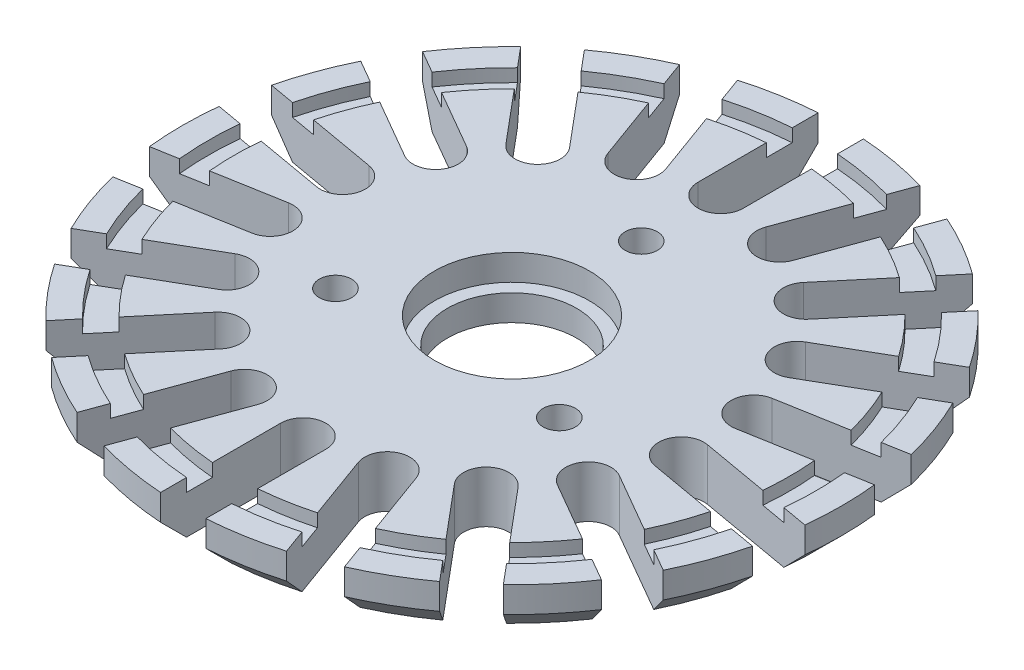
from build123d import *

# Parameters (mm, degrees)
ESBO_O1_R                = 5
RESSALTO_EXTRUS_O1_DEPTH = 4
ESBO_O2_R                = 6
CORTE_EXTRUS_O1_DEPTH    = 2
ESBO_O3_R                = 23.5
ESBO_O3_R_2              = 21.5
CORTE_EXTRUS_O2_DEPTH    = 1
CHANFRO1_SIZE            = 2
ESBO_O4_R                = 1.25
CORTE_EXTRUS_O3_DEPTH    = 37.241378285


with BuildPart() as part:
    # Esbo_o1 → Ressalto-extrus_o1 (new body)
    with BuildSketch(Plane(origin=(0, 0, 0), x_dir=(1, 0, 0), z_dir=(0, 1, 0))):
        with BuildLine():
            Line((1.75, 16.15), (1.75, 25.43988011))
            ThreePointArc((1.75, 25.43988011), (4.428028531, 25.112597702), (7.056489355, 24.504202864))
            Line((7.056489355, 24.504202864), (3.879163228, 15.774571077))
            ThreePointArc((3.879163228, 15.774571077), (4.925090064, 13.531573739), (7.168087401, 14.577500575))
            Line((7.168087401, 14.577500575), (10.345413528, 23.307132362))
            ThreePointArc((10.345413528, 23.307132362), (12.75, 22.083647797), (15.011861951, 20.612957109))
            Line((15.011861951, 20.612957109), (9.040442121, 13.496496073))
            ThreePointArc((9.040442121, 13.496496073), (9.256141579, 11.031039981), (11.721597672, 11.246739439))
            Line((11.721597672, 11.246739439), (17.693017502, 18.363200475))
            ThreePointArc((17.693017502, 18.363200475), (19.5341333, 16.391084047), (21.156582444, 14.235484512))
            Line((21.156582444, 14.235484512), (13.111310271, 9.590544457))
            ThreePointArc((13.111310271, 9.590544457), (12.470765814, 7.2), (14.861310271, 6.559455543))
            Line((14.861310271, 6.559455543), (22.906582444, 11.204395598))
            ThreePointArc((22.906582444, 11.204395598), (23.96216183, 8.721513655), (24.749506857, 6.141002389))
            Line((24.749506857, 6.141002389), (15.6007609, 4.527831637))
            ThreePointArc((15.6007609, 4.527831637), (14.181231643, 2.500533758), (16.208529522, 1.081004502))
            Line((16.208529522, 1.081004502), (25.357275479, 2.694175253))
            ThreePointArc((25.357275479, 2.694175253), (25.5, 0), (25.357275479, -2.694175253))
            Line((25.357275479, -2.694175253), (16.208529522, -1.081004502))
            ThreePointArc((16.208529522, -1.081004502), (14.181231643, -2.500533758), (15.6007609, -4.527831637))
            Line((15.6007609, -4.527831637), (24.749506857, -6.141002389))
            ThreePointArc((24.749506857, -6.141002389), (23.96216183, -8.721513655), (22.906582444, -11.204395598))
            Line((22.906582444, -11.204395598), (14.861310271, -6.559455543))
            ThreePointArc((14.861310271, -6.559455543), (12.470765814, -7.2), (13.111310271, -9.590544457))
            Line((13.111310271, -9.590544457), (21.156582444, -14.235484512))
            ThreePointArc((21.156582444, -14.235484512), (19.5341333, -16.391084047), (17.693017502, -18.363200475))
            Line((17.693017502, -18.363200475), (11.721597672, -11.246739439))
            ThreePointArc((11.721597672, -11.246739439), (9.256141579, -11.031039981), (9.040442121, -13.496496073))
            Line((9.040442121, -13.496496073), (15.011861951, -20.612957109))
            ThreePointArc((15.011861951, -20.612957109), (12.75, -22.083647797), (10.345413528, -23.307132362))
            Line((10.345413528, -23.307132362), (7.168087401, -14.577500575))
            ThreePointArc((7.168087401, -14.577500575), (4.925090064, -13.531573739), (3.879163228, -15.774571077))
            Line((3.879163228, -15.774571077), (7.056489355, -24.504202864))
            ThreePointArc((7.056489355, -24.504202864), (4.428028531, -25.112597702), (1.75, -25.43988011))
            Line((1.75, -25.43988011), (1.75, -16.15))
            ThreePointArc((1.75, -16.15), (0, -14.4), (-1.75, -16.15))
            Line((-1.75, -16.15), (-1.75, -25.43988011))
            ThreePointArc((-1.75, -25.43988011), (-4.428028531, -25.112597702), (-7.056489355, -24.504202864))
            Line((-7.056489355, -24.504202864), (-3.879163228, -15.774571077))
            ThreePointArc((-3.879163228, -15.774571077), (-4.925090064, -13.531573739), (-7.168087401, -14.577500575))
            Line((-7.168087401, -14.577500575), (-10.345413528, -23.307132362))
            ThreePointArc((-10.345413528, -23.307132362), (-12.75, -22.083647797), (-15.011861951, -20.612957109))
            Line((-15.011861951, -20.612957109), (-9.040442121, -13.496496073))
            ThreePointArc((-9.040442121, -13.496496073), (-9.256141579, -11.031039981), (-11.721597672, -11.246739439))
            Line((-11.721597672, -11.246739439), (-17.693017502, -18.363200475))
            ThreePointArc((-17.693017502, -18.363200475), (-19.5341333, -16.391084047), (-21.156582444, -14.235484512))
            Line((-21.156582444, -14.235484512), (-13.111310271, -9.590544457))
            ThreePointArc((-13.111310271, -9.590544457), (-12.470765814, -7.2), (-14.861310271, -6.559455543))
            Line((-14.861310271, -6.559455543), (-22.906582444, -11.204395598))
            ThreePointArc((-22.906582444, -11.204395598), (-23.96216183, -8.721513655), (-24.749506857, -6.141002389))
            Line((-24.749506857, -6.141002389), (-15.6007609, -4.527831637))
            ThreePointArc((-15.6007609, -4.527831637), (-14.181231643, -2.500533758), (-16.208529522, -1.081004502))
            Line((-16.208529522, -1.081004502), (-25.357275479, -2.694175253))
            ThreePointArc((-25.357275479, -2.694175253), (-25.5, 0), (-25.357275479, 2.694175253))
            Line((-25.357275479, 2.694175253), (-16.208529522, 1.081004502))
            ThreePointArc((-16.208529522, 1.081004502), (-14.181231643, 2.500533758), (-15.6007609, 4.527831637))
            Line((-15.6007609, 4.527831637), (-24.749506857, 6.141002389))
            ThreePointArc((-24.749506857, 6.141002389), (-23.96216183, 8.721513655), (-22.906582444, 11.204395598))
            Line((-22.906582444, 11.204395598), (-14.861310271, 6.559455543))
            ThreePointArc((-14.861310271, 6.559455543), (-12.470765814, 7.2), (-13.111310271, 9.590544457))
            Line((-13.111310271, 9.590544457), (-21.156582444, 14.235484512))
            ThreePointArc((-21.156582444, 14.235484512), (-19.5341333, 16.391084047), (-17.693017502, 18.363200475))
            Line((-17.693017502, 18.363200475), (-11.721597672, 11.246739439))
            ThreePointArc((-11.721597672, 11.246739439), (-9.256141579, 11.031039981), (-9.040442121, 13.496496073))
            Line((-9.040442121, 13.496496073), (-15.011861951, 20.612957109))
            ThreePointArc((-15.011861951, 20.612957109), (-12.75, 22.083647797), (-10.345413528, 23.307132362))
            Line((-10.345413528, 23.307132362), (-7.168087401, 14.577500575))
            ThreePointArc((-7.168087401, 14.577500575), (-4.925090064, 13.531573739), (-3.879163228, 15.774571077))
            Line((-3.879163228, 15.774571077), (-7.056489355, 24.504202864))
            ThreePointArc((-7.056489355, 24.504202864), (-4.428028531, 25.112597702), (-1.75, 25.43988011))
            Line((-1.75, 25.43988011), (-1.75, 16.15))
            ThreePointArc((-1.75, 16.15), (0, 14.4), (1.75, 16.15))
        make_face()
        with Locations(Location((0, 0, 0), (0, 0, 270))):
            Circle(ESBO_O1_R, mode=Mode.SUBTRACT)
    extrude(amount=RESSALTO_EXTRUS_O1_DEPTH)

    # Esbo_o2 → Corte-extrus_o1 (cut)
    with BuildSketch(Plane(origin=(0, 4, 0), x_dir=(1, 0, 0), z_dir=(0, 1, 0))):
        with Locations(Location((0, 0, 0), (0, 0, 270))):
            Circle(ESBO_O2_R)
    extrude(amount=-CORTE_EXTRUS_O1_DEPTH, mode=Mode.SUBTRACT)

    # Esbo_o3 → Corte-extrus_o2 (cut)
    with BuildSketch(Plane(origin=(0, 4, 0), x_dir=(1, 0, 0), z_dir=(0, 1, 0))):
        Circle(ESBO_O3_R)
        Circle(ESBO_O3_R_2, mode=Mode.SUBTRACT)
    extrude(amount=-CORTE_EXTRUS_O2_DEPTH, mode=Mode.SUBTRACT)

    # Chanfro1
    chanfro1_edges = [part.edges().sort_by_distance(p)[0] for p in [
        (4.428028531, 0, -25.112597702),
        (12.75, 0, -22.083647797),
        (19.5341333, 0, -16.391084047),
        (23.96216183, 0, -8.721513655),
        (25.5, 0, 0),
        (23.96216183, 0, 8.721513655),
        (19.5341333, 0, 16.391084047),
        (12.75, 0, 22.083647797),
        (4.428028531, 0, 25.112597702),
        (-4.428028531, 0, 25.112597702),
        (-12.75, 0, 22.083647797),
        (-19.5341333, 0, 16.391084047),
        (-23.96216183, 0, 8.721513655),
        (-25.5, 0, 0),
        (-23.96216183, 0, -8.721513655),
        (-19.5341333, 0, -16.391084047),
        (-12.75, 0, -22.083647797),
        (-4.428028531, 0, -25.112597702),
    ]]
    chamfer(chanfro1_edges, length=CHANFRO1_SIZE)

    # Esbo_o4 → Corte-extrus_o3 (cut, through all)
    with BuildSketch(Plane.XZ):
        with Locations(Location((0, -10, 0), (0, 0, 270))):
            Circle(ESBO_O4_R)
        with Locations(Location((-8.660254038, 5, 0), (0, 0, 270))):
            Circle(ESBO_O4_R)
        with Locations(Location((8.660254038, 5, 0), (0, 0, 270))):
            Circle(ESBO_O4_R)
    extrude(amount=-CORTE_EXTRUS_O3_DEPTH, mode=Mode.SUBTRACT)


solid = part.part
